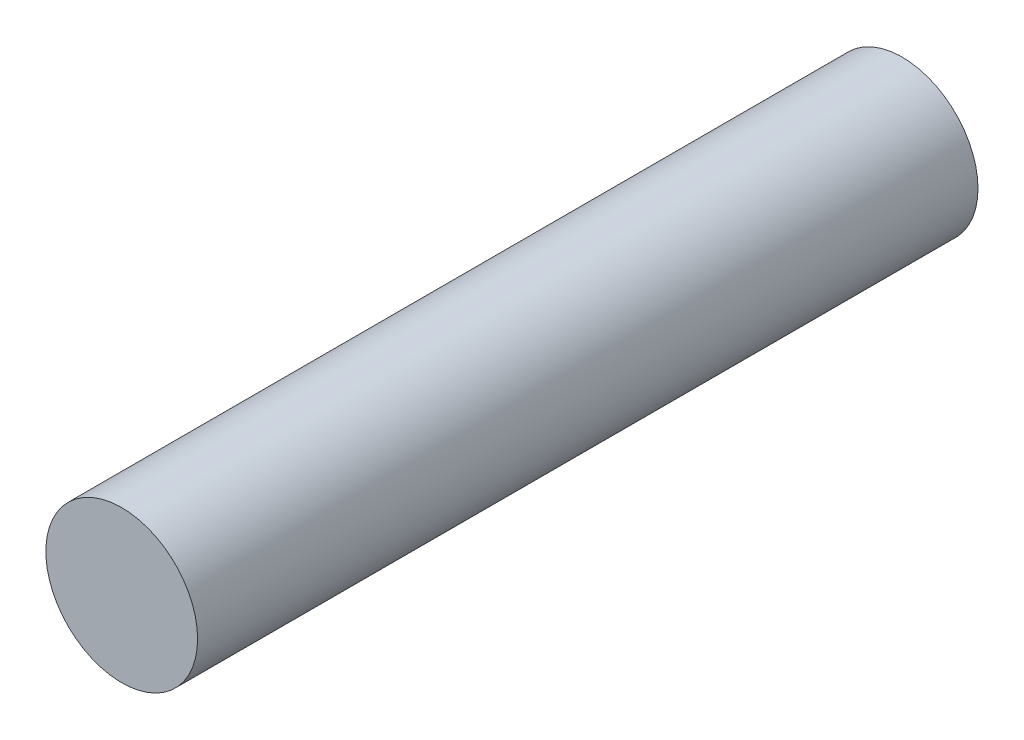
from build123d import *


with BuildPart() as part:
    # Sketch1 → Revolve1 (revolve)
    with BuildSketch(Plane(origin=(0, 0, 0), x_dir=(1, 0, 0), z_dir=(0, 1, 0))):
        Polygon((0, 0), (1.58496, 0), (1.58496, 16.304890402), (0.381, 16.5608), (0, 16.5608), align=None)
    revolve(axis=Axis((0, 0, 0), (0, 0, -1)))


solid = part.part
